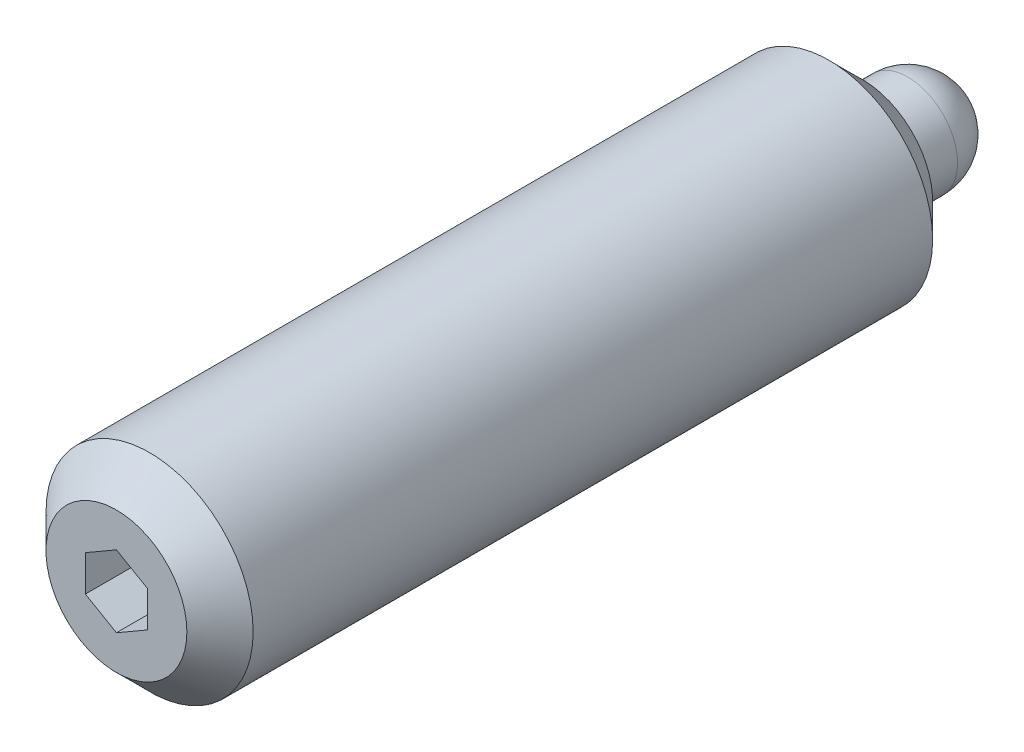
ISO-10303-21;
HEADER;
FILE_DESCRIPTION(('STEP AP214'),'2;1');
FILE_NAME('part.step','',(''),(''),'','','');
FILE_SCHEMA(('AUTOMOTIVE_DESIGN { 1 0 10303 214 1 1 1 1 }'));
ENDSEC;
DATA;
#1=APPLICATION_CONTEXT('core data for automotive mechanical design processes');
#2=APPLICATION_PROTOCOL_DEFINITION('international standard','automotive_design',2000,#1);
#3=PRODUCT_CONTEXT('',#1,'mechanical');
#4=PRODUCT('Part','Part','',(#3));
#5=PRODUCT_RELATED_PRODUCT_CATEGORY('part','',(#4));
#6=PRODUCT_DEFINITION_FORMATION('','',#4);
#7=PRODUCT_DEFINITION_CONTEXT('part definition',#1,'design');
#8=PRODUCT_DEFINITION('design','',#6,#7);
#9=PRODUCT_DEFINITION_SHAPE('','',#8);
#10=(LENGTH_UNIT() NAMED_UNIT(*) SI_UNIT(.MILLI.,.METRE.));
#11=(NAMED_UNIT(*) PLANE_ANGLE_UNIT() SI_UNIT($,.RADIAN.));
#12=(NAMED_UNIT(*) SI_UNIT($,.STERADIAN.) SOLID_ANGLE_UNIT());
#13=UNCERTAINTY_MEASURE_WITH_UNIT(LENGTH_MEASURE(1.E-05),#10,'distance_accuracy_value','');
#14=(GEOMETRIC_REPRESENTATION_CONTEXT(3) GLOBAL_UNCERTAINTY_ASSIGNED_CONTEXT((#13)) GLOBAL_UNIT_ASSIGNED_CONTEXT((#10,
#11,#12)) REPRESENTATION_CONTEXT('',''));
#15=CARTESIAN_POINT('',(0.,0.,0.));
#16=DIRECTION('',(0.,0.,1.));
#17=DIRECTION('',(1.,0.,0.));
#18=AXIS2_PLACEMENT_3D('',#15,#16,#17);
#19=CARTESIAN_POINT('',(0.,2.5,20.3));
#20=DIRECTION('',(0.,0.,1.));
#21=DIRECTION('',(1.,0.,0.));
#22=AXIS2_PLACEMENT_3D('',#19,#20,#21);
#23=PLANE('',#22);
#24=CARTESIAN_POINT('',(0.,0.,20.3));
#25=DIRECTION('',(0.,0.,1.));
#26=DIRECTION('',(1.,0.,0.));
#27=AXIS2_PLACEMENT_3D('',#24,#25,#26);
#28=CIRCLE('',#27,1.7);
#29=CARTESIAN_POINT('',(1.7,0.,20.3));
#30=VERTEX_POINT('',#29);
#31=EDGE_CURVE('E9',#30,#30,#28,.T.);
#32=ORIENTED_EDGE('',*,*,#31,.T.);
#33=EDGE_LOOP('',(#32));
#34=FACE_BOUND('',#33,.T.);
#35=DIRECTION('',(0.866025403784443,-0.499999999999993,0.));
#36=VECTOR('',#35,1.);
#37=CARTESIAN_POINT('',(-0.75,-0.433012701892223,20.3));
#38=LINE('',#37,#36);
#39=CARTESIAN_POINT('',(-0.75,-0.433012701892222,20.3));
#40=VERTEX_POINT('',#39);
#41=CARTESIAN_POINT('',(0.,-0.866025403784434,20.3));
#42=VERTEX_POINT('',#41);
#43=EDGE_CURVE('E84',#40,#42,#38,.T.);
#44=ORIENTED_EDGE('',*,*,#43,.F.);
#45=DIRECTION('',(0.,1.,0.));
#46=VECTOR('',#45,1.);
#47=CARTESIAN_POINT('',(-0.75,-0.433012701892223,20.3));
#48=LINE('',#47,#46);
#49=CARTESIAN_POINT('',(-0.75,0.433012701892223,20.3));
#50=VERTEX_POINT('',#49);
#51=EDGE_CURVE('E29',#40,#50,#48,.T.);
#52=ORIENTED_EDGE('',*,*,#51,.T.);
#53=DIRECTION('',(0.866025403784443,0.499999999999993,0.));
#54=VECTOR('',#53,1.);
#55=CARTESIAN_POINT('',(-0.75,0.433012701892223,20.3));
#56=LINE('',#55,#54);
#57=CARTESIAN_POINT('',(0.,0.866025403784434,20.3));
#58=VERTEX_POINT('',#57);
#59=EDGE_CURVE('E74',#50,#58,#56,.T.);
#60=ORIENTED_EDGE('',*,*,#59,.T.);
#61=DIRECTION('',(-0.866025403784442,0.499999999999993,0.));
#62=VECTOR('',#61,1.);
#63=CARTESIAN_POINT('',(0.75,0.433012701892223,20.3));
#64=LINE('',#63,#62);
#65=CARTESIAN_POINT('',(0.75,0.433012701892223,20.3));
#66=VERTEX_POINT('',#65);
#67=EDGE_CURVE('E79',#66,#58,#64,.T.);
#68=ORIENTED_EDGE('',*,*,#67,.F.);
#69=DIRECTION('',(0.,1.,0.));
#70=VECTOR('',#69,1.);
#71=CARTESIAN_POINT('',(0.75,-0.433012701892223,20.3));
#72=LINE('',#71,#70);
#73=CARTESIAN_POINT('',(0.75,-0.433012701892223,20.3));
#74=VERTEX_POINT('',#73);
#75=EDGE_CURVE('E88',#74,#66,#72,.T.);
#76=ORIENTED_EDGE('',*,*,#75,.F.);
#77=DIRECTION('',(-0.866025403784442,-0.499999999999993,0.));
#78=VECTOR('',#77,1.);
#79=CARTESIAN_POINT('',(0.75,-0.433012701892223,20.3));
#80=LINE('',#79,#78);
#81=EDGE_CURVE('E91',#74,#42,#80,.T.);
#82=ORIENTED_EDGE('',*,*,#81,.T.);
#83=EDGE_LOOP('',(#44,#52,#60,#68,#76,#82));
#84=FACE_BOUND('',#83,.T.);
#85=ADVANCED_FACE('F14',(#34,#84),#23,.T.);
#86=CARTESIAN_POINT('',(0.,0.,1.2));
#87=DIRECTION('',(-1.,0.,0.));
#88=DIRECTION('',(0.,0.,1.));
#89=AXIS2_PLACEMENT_3D('',#86,#87,#88);
#90=SPHERICAL_SURFACE('',#89,1.2);
#91=CARTESIAN_POINT('',(0.,0.,1.2));
#92=DIRECTION('',(0.,0.,-1.));
#93=DIRECTION('',(-1.,0.,0.));
#94=AXIS2_PLACEMENT_3D('',#91,#92,#93);
#95=SPHERICAL_SURFACE('',#94,1.2);
#96=CARTESIAN_POINT('',(0.,0.,1.2));
#97=DIRECTION('',(0.,0.,-1.));
#98=DIRECTION('',(-1.,0.,0.));
#99=AXIS2_PLACEMENT_3D('',#96,#97,#98);
#100=CIRCLE('',#99,1.2);
#101=CARTESIAN_POINT('',(-1.2,0.,1.2));
#102=VERTEX_POINT('',#101);
#103=EDGE_CURVE('E70',#102,#102,#100,.T.);
#104=ORIENTED_EDGE('',*,*,#103,.T.);
#105=EDGE_LOOP('',(#104));
#106=FACE_BOUND('',#105,.T.);
#107=ADVANCED_FACE('F152',(#106),#95,.T.);
#108=CARTESIAN_POINT('',(0.,0.,0.3));
#109=DIRECTION('',(0.,0.,-1.));
#110=DIRECTION('',(-1.,0.,0.));
#111=AXIS2_PLACEMENT_3D('',#108,#109,#110);
#112=CYLINDRICAL_SURFACE('',#111,2.5);
#113=CARTESIAN_POINT('',(0.,0.,3.1));
#114=DIRECTION('',(0.,0.,-1.));
#115=DIRECTION('',(-1.,0.,0.));
#116=AXIS2_PLACEMENT_3D('',#113,#114,#115);
#117=CIRCLE('',#116,2.5);
#118=CARTESIAN_POINT('',(-2.5,0.,3.1));
#119=VERTEX_POINT('',#118);
#120=EDGE_CURVE('E22',#119,#119,#117,.F.);
#121=ORIENTED_EDGE('',*,*,#120,.T.);
#122=EDGE_LOOP('',(#121));
#123=FACE_BOUND('',#122,.T.);
#124=CARTESIAN_POINT('',(0.,0.,19.5));
#125=DIRECTION('',(0.,0.,1.));
#126=DIRECTION('',(1.,0.,0.));
#127=AXIS2_PLACEMENT_3D('',#124,#125,#126);
#128=CIRCLE('',#127,2.5);
#129=CARTESIAN_POINT('',(2.5,0.,19.5));
#130=VERTEX_POINT('',#129);
#131=EDGE_CURVE('E125',#130,#130,#128,.F.);
#132=ORIENTED_EDGE('',*,*,#131,.T.);
#133=EDGE_LOOP('',(#132));
#134=FACE_BOUND('',#133,.T.);
#135=ADVANCED_FACE('F130',(#123,#134),#112,.T.);
#136=CARTESIAN_POINT('',(0.,1.2,2.3));
#137=DIRECTION('',(0.,0.,-1.));
#138=DIRECTION('',(-1.,0.,0.));
#139=AXIS2_PLACEMENT_3D('',#136,#137,#138);
#140=PLANE('',#139);
#141=CARTESIAN_POINT('',(0.,0.,2.3));
#142=DIRECTION('',(0.,0.,-1.));
#143=DIRECTION('',(-1.,0.,0.));
#144=AXIS2_PLACEMENT_3D('',#141,#142,#143);
#145=CIRCLE('',#144,1.7);
#146=CARTESIAN_POINT('',(-1.7,0.,2.3));
#147=VERTEX_POINT('',#146);
#148=EDGE_CURVE('E122',#147,#147,#145,.T.);
#149=ORIENTED_EDGE('',*,*,#148,.T.);
#150=EDGE_LOOP('',(#149));
#151=FACE_BOUND('',#150,.T.);
#152=CARTESIAN_POINT('',(0.,0.,2.3));
#153=DIRECTION('',(0.,0.,-1.));
#154=DIRECTION('',(-1.,0.,0.));
#155=AXIS2_PLACEMENT_3D('',#152,#153,#154);
#156=CIRCLE('',#155,1.2);
#157=CARTESIAN_POINT('',(-1.2,0.,2.3));
#158=VERTEX_POINT('',#157);
#159=EDGE_CURVE('E119',#158,#158,#156,.T.);
#160=ORIENTED_EDGE('',*,*,#159,.F.);
#161=EDGE_LOOP('',(#160));
#162=FACE_BOUND('',#161,.T.);
#163=ADVANCED_FACE('F140',(#151,#162),#140,.T.);
#164=CARTESIAN_POINT('',(0.,0.,0.3));
#165=DIRECTION('',(0.,0.,-1.));
#166=DIRECTION('',(-1.,0.,0.));
#167=AXIS2_PLACEMENT_3D('',#164,#165,#166);
#168=CYLINDRICAL_SURFACE('',#167,1.2);
#169=ORIENTED_EDGE('',*,*,#159,.T.);
#170=EDGE_LOOP('',(#169));
#171=FACE_BOUND('',#170,.T.);
#172=ORIENTED_EDGE('',*,*,#103,.F.);
#173=EDGE_LOOP('',(#172));
#174=FACE_BOUND('',#173,.T.);
#175=ADVANCED_FACE('F143',(#171,#174),#168,.T.);
#176=CARTESIAN_POINT('',(-0.75,-0.433012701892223,18.3));
#177=DIRECTION('',(1.,0.,0.));
#178=DIRECTION('',(0.,0.,-1.));
#179=AXIS2_PLACEMENT_3D('',#176,#177,#178);
#180=PLANE('',#179);
#181=DIRECTION('',(0.,0.,1.));
#182=VECTOR('',#181,1.);
#183=CARTESIAN_POINT('',(-0.75,0.433012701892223,18.3));
#184=LINE('',#183,#182);
#185=CARTESIAN_POINT('',(-0.75,0.433012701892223,18.3));
#186=VERTEX_POINT('',#185);
#187=EDGE_CURVE('E63',#186,#50,#184,.T.);
#188=ORIENTED_EDGE('',*,*,#187,.T.);
#189=ORIENTED_EDGE('',*,*,#51,.F.);
#190=DIRECTION('',(0.,0.,1.));
#191=VECTOR('',#190,1.);
#192=CARTESIAN_POINT('',(-0.75,-0.433012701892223,18.3));
#193=LINE('',#192,#191);
#194=CARTESIAN_POINT('',(-0.75,-0.433012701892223,18.3));
#195=VERTEX_POINT('',#194);
#196=EDGE_CURVE('E33',#195,#40,#193,.T.);
#197=ORIENTED_EDGE('',*,*,#196,.F.);
#198=DIRECTION('',(0.,1.,0.));
#199=VECTOR('',#198,1.);
#200=CARTESIAN_POINT('',(-0.75,-0.433012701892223,18.3));
#201=LINE('',#200,#199);
#202=EDGE_CURVE('E66',#195,#186,#201,.T.);
#203=ORIENTED_EDGE('',*,*,#202,.T.);
#204=EDGE_LOOP('',(#188,#189,#197,#203));
#205=FACE_BOUND('',#204,.T.);
#206=ADVANCED_FACE('F65',(#205),#180,.T.);
#207=CARTESIAN_POINT('',(-0.75,0.433012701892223,18.3));
#208=DIRECTION('',(0.499999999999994,-0.866025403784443,0.));
#209=DIRECTION('',(0.866025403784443,0.499999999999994,0.));
#210=AXIS2_PLACEMENT_3D('',#207,#208,#209);
#211=PLANE('',#210);
#212=DIRECTION('',(0.,0.,1.));
#213=VECTOR('',#212,1.);
#214=CARTESIAN_POINT('',(0.,0.866025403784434,18.3));
#215=LINE('',#214,#213);
#216=CARTESIAN_POINT('',(0.,0.866025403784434,18.3));
#217=VERTEX_POINT('',#216);
#218=EDGE_CURVE('E71',#217,#58,#215,.T.);
#219=ORIENTED_EDGE('',*,*,#218,.T.);
#220=ORIENTED_EDGE('',*,*,#59,.F.);
#221=ORIENTED_EDGE('',*,*,#187,.F.);
#222=DIRECTION('',(0.866025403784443,0.499999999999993,0.));
#223=VECTOR('',#222,1.);
#224=CARTESIAN_POINT('',(-0.75,0.433012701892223,18.3));
#225=LINE('',#224,#223);
#226=EDGE_CURVE('E95',#186,#217,#225,.T.);
#227=ORIENTED_EDGE('',*,*,#226,.T.);
#228=EDGE_LOOP('',(#219,#220,#221,#227));
#229=FACE_BOUND('',#228,.T.);
#230=ADVANCED_FACE('F75',(#229),#211,.T.);
#231=CARTESIAN_POINT('',(0.75,0.433012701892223,18.3));
#232=DIRECTION('',(0.499999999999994,0.866025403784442,0.));
#233=DIRECTION('',(-0.866025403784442,0.499999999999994,0.));
#234=AXIS2_PLACEMENT_3D('',#231,#232,#233);
#235=PLANE('',#234);
#236=DIRECTION('',(0.,0.,1.));
#237=VECTOR('',#236,1.);
#238=CARTESIAN_POINT('',(0.75,0.433012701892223,18.3));
#239=LINE('',#238,#237);
#240=CARTESIAN_POINT('',(0.75,0.433012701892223,18.3));
#241=VERTEX_POINT('',#240);
#242=EDGE_CURVE('E114',#241,#66,#239,.T.);
#243=ORIENTED_EDGE('',*,*,#242,.T.);
#244=ORIENTED_EDGE('',*,*,#67,.T.);
#245=ORIENTED_EDGE('',*,*,#218,.F.);
#246=DIRECTION('',(-0.866025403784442,0.499999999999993,0.));
#247=VECTOR('',#246,1.);
#248=CARTESIAN_POINT('',(0.75,0.433012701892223,18.3));
#249=LINE('',#248,#247);
#250=EDGE_CURVE('E97',#241,#217,#249,.T.);
#251=ORIENTED_EDGE('',*,*,#250,.F.);
#252=EDGE_LOOP('',(#243,#244,#245,#251));
#253=FACE_BOUND('',#252,.T.);
#254=ADVANCED_FACE('F167',(#253),#235,.F.);
#255=CARTESIAN_POINT('',(0.75,-0.433012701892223,18.3));
#256=DIRECTION('',(1.,0.,0.));
#257=DIRECTION('',(0.,0.,-1.));
#258=AXIS2_PLACEMENT_3D('',#255,#256,#257);
#259=PLANE('',#258);
#260=DIRECTION('',(0.,0.,1.));
#261=VECTOR('',#260,1.);
#262=CARTESIAN_POINT('',(0.75,-0.433012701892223,18.3));
#263=LINE('',#262,#261);
#264=CARTESIAN_POINT('',(0.75,-0.433012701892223,18.3));
#265=VERTEX_POINT('',#264);
#266=EDGE_CURVE('E112',#265,#74,#263,.T.);
#267=ORIENTED_EDGE('',*,*,#266,.T.);
#268=ORIENTED_EDGE('',*,*,#75,.T.);
#269=ORIENTED_EDGE('',*,*,#242,.F.);
#270=DIRECTION('',(0.,1.,0.));
#271=VECTOR('',#270,1.);
#272=CARTESIAN_POINT('',(0.75,-0.433012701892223,18.3));
#273=LINE('',#272,#271);
#274=EDGE_CURVE('E100',#265,#241,#273,.T.);
#275=ORIENTED_EDGE('',*,*,#274,.F.);
#276=EDGE_LOOP('',(#267,#268,#269,#275));
#277=FACE_BOUND('',#276,.T.);
#278=ADVANCED_FACE('F170',(#277),#259,.F.);
#279=CARTESIAN_POINT('',(0.75,-0.433012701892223,18.3));
#280=DIRECTION('',(-0.499999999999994,0.866025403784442,0.));
#281=DIRECTION('',(-0.866025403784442,-0.499999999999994,0.));
#282=AXIS2_PLACEMENT_3D('',#279,#280,#281);
#283=PLANE('',#282);
#284=DIRECTION('',(0.,0.,1.));
#285=VECTOR('',#284,1.);
#286=CARTESIAN_POINT('',(0.,-0.866025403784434,18.3));
#287=LINE('',#286,#285);
#288=CARTESIAN_POINT('',(0.,-0.866025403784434,18.3));
#289=VERTEX_POINT('',#288);
#290=EDGE_CURVE('E110',#289,#42,#287,.T.);
#291=ORIENTED_EDGE('',*,*,#290,.T.);
#292=ORIENTED_EDGE('',*,*,#81,.F.);
#293=ORIENTED_EDGE('',*,*,#266,.F.);
#294=DIRECTION('',(-0.866025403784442,-0.499999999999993,0.));
#295=VECTOR('',#294,1.);
#296=CARTESIAN_POINT('',(0.75,-0.433012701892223,18.3));
#297=LINE('',#296,#295);
#298=EDGE_CURVE('E103',#265,#289,#297,.T.);
#299=ORIENTED_EDGE('',*,*,#298,.T.);
#300=EDGE_LOOP('',(#291,#292,#293,#299));
#301=FACE_BOUND('',#300,.T.);
#302=ADVANCED_FACE('F174',(#301),#283,.T.);
#303=CARTESIAN_POINT('',(-0.75,-0.433012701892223,18.3));
#304=DIRECTION('',(-0.499999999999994,-0.866025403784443,0.));
#305=DIRECTION('',(0.866025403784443,-0.499999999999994,0.));
#306=AXIS2_PLACEMENT_3D('',#303,#304,#305);
#307=PLANE('',#306);
#308=DIRECTION('',(0.866025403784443,-0.499999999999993,0.));
#309=VECTOR('',#308,1.);
#310=CARTESIAN_POINT('',(-0.75,-0.433012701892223,18.3));
#311=LINE('',#310,#309);
#312=EDGE_CURVE('E106',#195,#289,#311,.T.);
#313=ORIENTED_EDGE('',*,*,#312,.F.);
#314=ORIENTED_EDGE('',*,*,#196,.T.);
#315=ORIENTED_EDGE('',*,*,#43,.T.);
#316=ORIENTED_EDGE('',*,*,#290,.F.);
#317=EDGE_LOOP('',(#313,#314,#315,#316));
#318=FACE_BOUND('',#317,.T.);
#319=ADVANCED_FACE('F137',(#318),#307,.F.);
#320=CARTESIAN_POINT('',(-0.75,0.433012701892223,18.3));
#321=DIRECTION('',(0.,0.,-1.));
#322=DIRECTION('',(-1.,0.,0.));
#323=AXIS2_PLACEMENT_3D('',#320,#321,#322);
#324=PLANE('',#323);
#325=ORIENTED_EDGE('',*,*,#202,.F.);
#326=ORIENTED_EDGE('',*,*,#312,.T.);
#327=ORIENTED_EDGE('',*,*,#298,.F.);
#328=ORIENTED_EDGE('',*,*,#274,.T.);
#329=ORIENTED_EDGE('',*,*,#250,.T.);
#330=ORIENTED_EDGE('',*,*,#226,.F.);
#331=EDGE_LOOP('',(#325,#326,#327,#328,#329,#330));
#332=FACE_BOUND('',#331,.T.);
#333=ADVANCED_FACE('F136',(#332),#324,.F.);
#334=CARTESIAN_POINT('',(0.,0.,2.3));
#335=DIRECTION('',(0.,0.,1.));
#336=DIRECTION('',(1.,0.,0.));
#337=AXIS2_PLACEMENT_3D('',#334,#335,#336);
#338=CONICAL_SURFACE('',#337,1.7,0.785398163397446);
#339=ORIENTED_EDGE('',*,*,#120,.F.);
#340=EDGE_LOOP('',(#339));
#341=FACE_BOUND('',#340,.T.);
#342=ORIENTED_EDGE('',*,*,#148,.F.);
#343=EDGE_LOOP('',(#342));
#344=FACE_BOUND('',#343,.T.);
#345=ADVANCED_FACE('F133',(#341,#344),#338,.T.);
#346=CARTESIAN_POINT('',(0.,0.,19.5));
#347=DIRECTION('',(0.,0.,-1.));
#348=DIRECTION('',(-1.,0.,0.));
#349=AXIS2_PLACEMENT_3D('',#346,#347,#348);
#350=CONICAL_SURFACE('',#349,2.5,0.785398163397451);
#351=ORIENTED_EDGE('',*,*,#31,.F.);
#352=EDGE_LOOP('',(#351));
#353=FACE_BOUND('',#352,.T.);
#354=ORIENTED_EDGE('',*,*,#131,.F.);
#355=EDGE_LOOP('',(#354));
#356=FACE_BOUND('',#355,.T.);
#357=ADVANCED_FACE('F16',(#353,#356),#350,.T.);
#358=CLOSED_SHELL('',(#85,#107,#135,#163,#175,#206,#230,#254,#278,#302,#319,#333,#345,#357));
#359=MANIFOLD_SOLID_BREP('B1',#358);
#360=ADVANCED_BREP_SHAPE_REPRESENTATION('',(#18,#359),#14);
#361=SHAPE_DEFINITION_REPRESENTATION(#9,#360);
ENDSEC;
END-ISO-10303-21;
